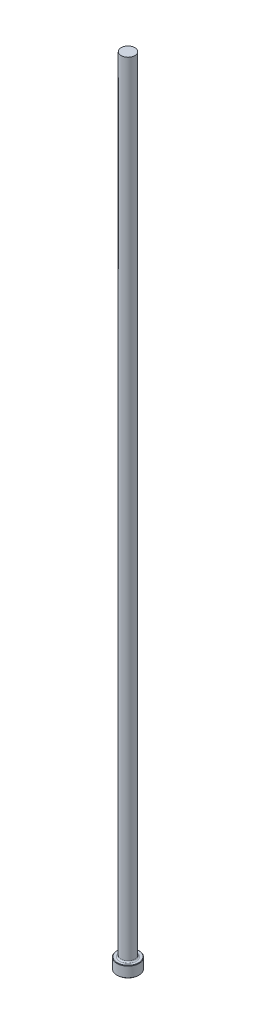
ISO-10303-21;
HEADER;
FILE_DESCRIPTION(('STEP AP214'),'2;1');
FILE_NAME('part.step','',(''),(''),'','','');
FILE_SCHEMA(('AUTOMOTIVE_DESIGN { 1 0 10303 214 1 1 1 1 }'));
ENDSEC;
DATA;
#1=APPLICATION_CONTEXT('core data for automotive mechanical design processes');
#2=APPLICATION_PROTOCOL_DEFINITION('international standard','automotive_design',2000,#1);
#3=PRODUCT_CONTEXT('',#1,'mechanical');
#4=PRODUCT('Part','Part','',(#3));
#5=PRODUCT_RELATED_PRODUCT_CATEGORY('part','',(#4));
#6=PRODUCT_DEFINITION_FORMATION('','',#4);
#7=PRODUCT_DEFINITION_CONTEXT('part definition',#1,'design');
#8=PRODUCT_DEFINITION('design','',#6,#7);
#9=PRODUCT_DEFINITION_SHAPE('','',#8);
#10=(LENGTH_UNIT() NAMED_UNIT(*) SI_UNIT(.MILLI.,.METRE.));
#11=(NAMED_UNIT(*) PLANE_ANGLE_UNIT() SI_UNIT($,.RADIAN.));
#12=(NAMED_UNIT(*) SI_UNIT($,.STERADIAN.) SOLID_ANGLE_UNIT());
#13=UNCERTAINTY_MEASURE_WITH_UNIT(LENGTH_MEASURE(1.E-05),#10,'distance_accuracy_value','');
#14=(GEOMETRIC_REPRESENTATION_CONTEXT(3) GLOBAL_UNCERTAINTY_ASSIGNED_CONTEXT((#13)) GLOBAL_UNIT_ASSIGNED_CONTEXT((#10,
#11,#12)) REPRESENTATION_CONTEXT('',''));
#15=CARTESIAN_POINT('',(0.,0.,0.));
#16=DIRECTION('',(0.,0.,1.));
#17=DIRECTION('',(1.,0.,0.));
#18=AXIS2_PLACEMENT_3D('',#15,#16,#17);
#19=CARTESIAN_POINT('',(0.,0.,0.));
#20=DIRECTION('',(0.,-1.,0.));
#21=DIRECTION('',(0.,0.,-1.));
#22=AXIS2_PLACEMENT_3D('',#19,#20,#21);
#23=PLANE('',#22);
#24=CARTESIAN_POINT('',(0.,0.,0.));
#25=DIRECTION('',(0.,-1.,0.));
#26=DIRECTION('',(0.,0.,-1.));
#27=AXIS2_PLACEMENT_3D('',#24,#25,#26);
#28=CIRCLE('',#27,6.09599999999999);
#29=CARTESIAN_POINT('',(0.,0.,-6.09599999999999));
#30=VERTEX_POINT('',#29);
#31=EDGE_CURVE('E46',#30,#30,#28,.T.);
#32=ORIENTED_EDGE('',*,*,#31,.T.);
#33=EDGE_LOOP('',(#32));
#34=FACE_BOUND('',#33,.T.);
#35=ADVANCED_FACE('F35',(#34),#23,.T.);
#36=CARTESIAN_POINT('',(0.,259.958771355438,0.));
#37=DIRECTION('',(0.,1.,0.));
#38=DIRECTION('',(0.,0.,1.));
#39=AXIS2_PLACEMENT_3D('',#36,#37,#38);
#40=CYLINDRICAL_SURFACE('',#39,6.34999999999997);
#41=CARTESIAN_POINT('',(0.,6.09599999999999,0.));
#42=DIRECTION('',(0.,1.,0.));
#43=DIRECTION('',(0.,0.,1.));
#44=AXIS2_PLACEMENT_3D('',#41,#42,#43);
#45=CIRCLE('',#44,6.34999999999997);
#46=CARTESIAN_POINT('',(0.,6.09599999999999,6.34999999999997));
#47=VERTEX_POINT('',#46);
#48=EDGE_CURVE('E50',#47,#47,#45,.F.);
#49=ORIENTED_EDGE('',*,*,#48,.T.);
#50=EDGE_LOOP('',(#49));
#51=FACE_BOUND('',#50,.T.);
#52=CARTESIAN_POINT('',(0.,0.253999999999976,0.));
#53=DIRECTION('',(0.,-1.,0.));
#54=DIRECTION('',(0.,0.,-1.));
#55=AXIS2_PLACEMENT_3D('',#52,#53,#54);
#56=CIRCLE('',#55,6.34999999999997);
#57=CARTESIAN_POINT('',(0.,0.253999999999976,-6.34999999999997));
#58=VERTEX_POINT('',#57);
#59=EDGE_CURVE('E55',#58,#58,#56,.F.);
#60=ORIENTED_EDGE('',*,*,#59,.T.);
#61=EDGE_LOOP('',(#60));
#62=FACE_BOUND('',#61,.T.);
#63=ADVANCED_FACE('F77',(#51,#62),#40,.T.);
#64=CARTESIAN_POINT('',(-6.34999999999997,6.35,0.));
#65=DIRECTION('',(0.,1.,0.));
#66=DIRECTION('',(0.,0.,1.));
#67=AXIS2_PLACEMENT_3D('',#64,#65,#66);
#68=PLANE('',#67);
#69=CARTESIAN_POINT('',(0.,6.35,0.));
#70=DIRECTION('',(0.,1.,0.));
#71=DIRECTION('',(0.,0.,1.));
#72=AXIS2_PLACEMENT_3D('',#69,#70,#71);
#73=CIRCLE('',#72,4.73074999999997);
#74=CARTESIAN_POINT('',(0.,6.35,4.73074999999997));
#75=VERTEX_POINT('',#74);
#76=EDGE_CURVE('E10',#75,#75,#73,.F.);
#77=ORIENTED_EDGE('',*,*,#76,.T.);
#78=EDGE_LOOP('',(#77));
#79=FACE_BOUND('',#78,.T.);
#80=CARTESIAN_POINT('',(0.,6.35,0.));
#81=DIRECTION('',(0.,1.,0.));
#82=DIRECTION('',(0.,0.,1.));
#83=AXIS2_PLACEMENT_3D('',#80,#81,#82);
#84=CIRCLE('',#83,6.09599999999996);
#85=CARTESIAN_POINT('',(0.,6.35,6.09599999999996));
#86=VERTEX_POINT('',#85);
#87=EDGE_CURVE('E58',#86,#86,#84,.T.);
#88=ORIENTED_EDGE('',*,*,#87,.T.);
#89=EDGE_LOOP('',(#88));
#90=FACE_BOUND('',#89,.T.);
#91=ADVANCED_FACE('F69',(#79,#90),#68,.T.);
#92=CARTESIAN_POINT('',(0.,259.958771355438,0.));
#93=DIRECTION('',(0.,1.,0.));
#94=DIRECTION('',(0.,0.,1.));
#95=AXIS2_PLACEMENT_3D('',#92,#93,#94);
#96=CYLINDRICAL_SURFACE('',#95,3.96874999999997);
#97=CARTESIAN_POINT('',(0.,7.11200000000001,0.));
#98=DIRECTION('',(0.,1.,0.));
#99=DIRECTION('',(0.,0.,1.));
#100=AXIS2_PLACEMENT_3D('',#97,#98,#99);
#101=CIRCLE('',#100,3.96874999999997);
#102=CARTESIAN_POINT('',(0.,7.11200000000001,3.96874999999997));
#103=VERTEX_POINT('',#102);
#104=EDGE_CURVE('E42',#103,#103,#101,.T.);
#105=ORIENTED_EDGE('',*,*,#104,.T.);
#106=EDGE_LOOP('',(#105));
#107=FACE_BOUND('',#106,.T.);
#108=CARTESIAN_POINT('',(0.,457.2,0.));
#109=DIRECTION('',(0.,1.,0.));
#110=DIRECTION('',(0.,0.,1.));
#111=AXIS2_PLACEMENT_3D('',#108,#109,#110);
#112=CIRCLE('',#111,3.96874999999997);
#113=CARTESIAN_POINT('',(0.,457.2,3.96874999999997));
#114=VERTEX_POINT('',#113);
#115=EDGE_CURVE('E61',#114,#114,#112,.T.);
#116=ORIENTED_EDGE('',*,*,#115,.F.);
#117=EDGE_LOOP('',(#116));
#118=FACE_BOUND('',#117,.T.);
#119=ADVANCED_FACE('F67',(#107,#118),#96,.T.);
#120=CARTESIAN_POINT('',(-3.96874999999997,457.2,0.));
#121=DIRECTION('',(0.,1.,0.));
#122=DIRECTION('',(0.,0.,1.));
#123=AXIS2_PLACEMENT_3D('',#120,#121,#122);
#124=PLANE('',#123);
#125=ORIENTED_EDGE('',*,*,#115,.T.);
#126=EDGE_LOOP('',(#125));
#127=FACE_BOUND('',#126,.T.);
#128=ADVANCED_FACE('F65',(#127),#124,.T.);
#129=CARTESIAN_POINT('',(0.,6.35000000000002,0.));
#130=DIRECTION('',(0.,-1.,0.));
#131=DIRECTION('',(0.,0.,-1.));
#132=AXIS2_PLACEMENT_3D('',#129,#130,#131);
#133=CONICAL_SURFACE('',#132,6.09599999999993,0.78539816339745);
#134=ORIENTED_EDGE('',*,*,#48,.F.);
#135=EDGE_LOOP('',(#134));
#136=FACE_BOUND('',#135,.T.);
#137=ORIENTED_EDGE('',*,*,#87,.F.);
#138=EDGE_LOOP('',(#137));
#139=FACE_BOUND('',#138,.T.);
#140=ADVANCED_FACE('F75',(#136,#139),#133,.T.);
#141=CARTESIAN_POINT('',(0.,0.253999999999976,0.));
#142=DIRECTION('',(0.,1.,0.));
#143=DIRECTION('',(0.,0.,1.));
#144=AXIS2_PLACEMENT_3D('',#141,#142,#143);
#145=CONICAL_SURFACE('',#144,6.34999999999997,0.78539816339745);
#146=ORIENTED_EDGE('',*,*,#31,.F.);
#147=EDGE_LOOP('',(#146));
#148=FACE_BOUND('',#147,.T.);
#149=ORIENTED_EDGE('',*,*,#59,.F.);
#150=EDGE_LOOP('',(#149));
#151=FACE_BOUND('',#150,.T.);
#152=ADVANCED_FACE('F89',(#148,#151),#145,.T.);
#153=CARTESIAN_POINT('',(0.,7.11200000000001,0.));
#154=DIRECTION('',(0.,1.,0.));
#155=DIRECTION('',(0.,0.,1.));
#156=AXIS2_PLACEMENT_3D('',#153,#154,#155);
#157=TOROIDAL_SURFACE('',#156,4.73074999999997,0.762);
#158=ORIENTED_EDGE('',*,*,#76,.F.);
#159=EDGE_LOOP('',(#158));
#160=FACE_BOUND('',#159,.T.);
#161=ORIENTED_EDGE('',*,*,#104,.F.);
#162=EDGE_LOOP('',(#161));
#163=FACE_BOUND('',#162,.T.);
#164=ADVANCED_FACE('F37',(#160,#163),#157,.F.);
#165=CLOSED_SHELL('',(#35,#63,#91,#119,#128,#140,#152,#164));
#166=MANIFOLD_SOLID_BREP('B2',#165);
#167=ADVANCED_BREP_SHAPE_REPRESENTATION('',(#18,#166),#14);
#168=SHAPE_DEFINITION_REPRESENTATION(#9,#167);
ENDSEC;
END-ISO-10303-21;
